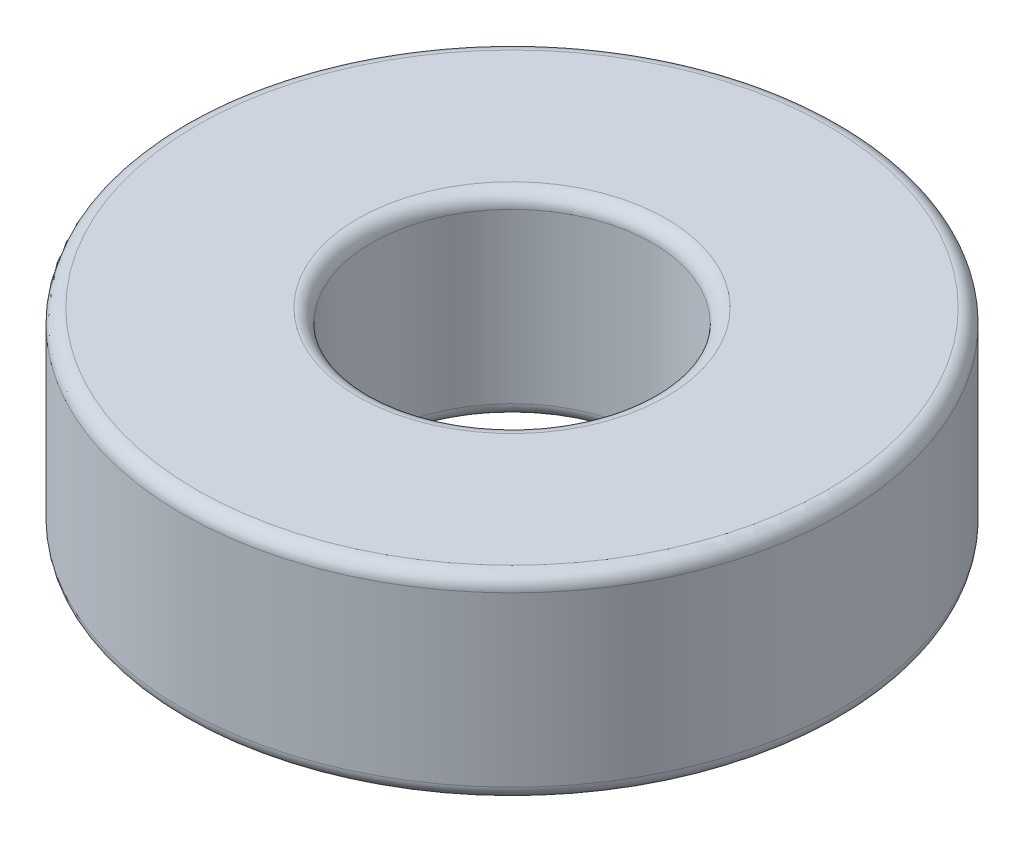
ISO-10303-21;
HEADER;
FILE_DESCRIPTION(('STEP AP214'),'2;1');
FILE_NAME('part.step','',(''),(''),'','','');
FILE_SCHEMA(('AUTOMOTIVE_DESIGN { 1 0 10303 214 1 1 1 1 }'));
ENDSEC;
DATA;
#1=APPLICATION_CONTEXT('core data for automotive mechanical design processes');
#2=APPLICATION_PROTOCOL_DEFINITION('international standard','automotive_design',2000,#1);
#3=PRODUCT_CONTEXT('',#1,'mechanical');
#4=PRODUCT('Part','Part','',(#3));
#5=PRODUCT_RELATED_PRODUCT_CATEGORY('part','',(#4));
#6=PRODUCT_DEFINITION_FORMATION('','',#4);
#7=PRODUCT_DEFINITION_CONTEXT('part definition',#1,'design');
#8=PRODUCT_DEFINITION('design','',#6,#7);
#9=PRODUCT_DEFINITION_SHAPE('','',#8);
#10=(LENGTH_UNIT() NAMED_UNIT(*) SI_UNIT(.MILLI.,.METRE.));
#11=(NAMED_UNIT(*) PLANE_ANGLE_UNIT() SI_UNIT($,.RADIAN.));
#12=(NAMED_UNIT(*) SI_UNIT($,.STERADIAN.) SOLID_ANGLE_UNIT());
#13=UNCERTAINTY_MEASURE_WITH_UNIT(LENGTH_MEASURE(1.E-05),#10,'distance_accuracy_value','');
#14=(GEOMETRIC_REPRESENTATION_CONTEXT(3) GLOBAL_UNCERTAINTY_ASSIGNED_CONTEXT((#13)) GLOBAL_UNIT_ASSIGNED_CONTEXT((#10,
#11,#12)) REPRESENTATION_CONTEXT('',''));
#15=CARTESIAN_POINT('',(0.,0.,0.));
#16=DIRECTION('',(0.,0.,1.));
#17=DIRECTION('',(1.,0.,0.));
#18=AXIS2_PLACEMENT_3D('',#15,#16,#17);
#19=CARTESIAN_POINT('',(0.,13.,0.));
#20=DIRECTION('',(0.,1.,0.));
#21=DIRECTION('',(0.,0.,1.));
#22=AXIS2_PLACEMENT_3D('',#19,#20,#21);
#23=TOROIDAL_SURFACE('',#22,11.,0.999999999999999);
#24=CARTESIAN_POINT('',(0.,13.,0.));
#25=DIRECTION('',(0.,1.,0.));
#26=DIRECTION('',(0.,0.,1.));
#27=AXIS2_PLACEMENT_3D('',#24,#25,#26);
#28=CIRCLE('',#27,10.);
#29=CARTESIAN_POINT('',(0.,13.,10.));
#30=VERTEX_POINT('',#29);
#31=EDGE_CURVE('E10',#30,#30,#28,.T.);
#32=ORIENTED_EDGE('',*,*,#31,.F.);
#33=EDGE_LOOP('',(#32));
#34=FACE_BOUND('',#33,.T.);
#35=CARTESIAN_POINT('',(0.,14.,0.));
#36=DIRECTION('',(0.,1.,0.));
#37=DIRECTION('',(0.,0.,1.));
#38=AXIS2_PLACEMENT_3D('',#35,#36,#37);
#39=CIRCLE('',#38,11.);
#40=CARTESIAN_POINT('',(0.,14.,11.));
#41=VERTEX_POINT('',#40);
#42=EDGE_CURVE('E54',#41,#41,#39,.T.);
#43=ORIENTED_EDGE('',*,*,#42,.T.);
#44=EDGE_LOOP('',(#43));
#45=FACE_BOUND('',#44,.T.);
#46=ADVANCED_FACE('F26',(#34,#45),#23,.T.);
#47=CARTESIAN_POINT('',(0.,15.5125,0.));
#48=DIRECTION('',(0.,1.,0.));
#49=DIRECTION('',(0.,0.,1.));
#50=AXIS2_PLACEMENT_3D('',#47,#48,#49);
#51=CYLINDRICAL_SURFACE('',#50,10.);
#52=ORIENTED_EDGE('',*,*,#31,.T.);
#53=EDGE_LOOP('',(#52));
#54=FACE_BOUND('',#53,.T.);
#55=CARTESIAN_POINT('',(0.,1.00000000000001,0.));
#56=DIRECTION('',(0.,1.,0.));
#57=DIRECTION('',(0.,0.,1.));
#58=AXIS2_PLACEMENT_3D('',#55,#56,#57);
#59=CIRCLE('',#58,9.99999999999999);
#60=CARTESIAN_POINT('',(0.,1.00000000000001,9.99999999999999));
#61=VERTEX_POINT('',#60);
#62=EDGE_CURVE('E32',#61,#61,#59,.T.);
#63=ORIENTED_EDGE('',*,*,#62,.F.);
#64=EDGE_LOOP('',(#63));
#65=FACE_BOUND('',#64,.T.);
#66=ADVANCED_FACE('F83',(#54,#65),#51,.F.);
#67=CARTESIAN_POINT('',(0.,0.999999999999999,0.));
#68=DIRECTION('',(0.,1.,0.));
#69=DIRECTION('',(0.,0.,1.));
#70=AXIS2_PLACEMENT_3D('',#67,#68,#69);
#71=TOROIDAL_SURFACE('',#70,11.,1.);
#72=CARTESIAN_POINT('',(0.,0.,0.));
#73=DIRECTION('',(0.,1.,0.));
#74=DIRECTION('',(0.,0.,1.));
#75=AXIS2_PLACEMENT_3D('',#72,#73,#74);
#76=CIRCLE('',#75,11.);
#77=CARTESIAN_POINT('',(0.,0.,11.));
#78=VERTEX_POINT('',#77);
#79=EDGE_CURVE('E36',#78,#78,#76,.T.);
#80=ORIENTED_EDGE('',*,*,#79,.F.);
#81=EDGE_LOOP('',(#80));
#82=FACE_BOUND('',#81,.T.);
#83=ORIENTED_EDGE('',*,*,#62,.T.);
#84=EDGE_LOOP('',(#83));
#85=FACE_BOUND('',#84,.T.);
#86=ADVANCED_FACE('F88',(#82,#85),#71,.T.);
#87=CARTESIAN_POINT('',(11.,0.,0.));
#88=DIRECTION('',(0.,1.,0.));
#89=DIRECTION('',(0.,0.,1.));
#90=AXIS2_PLACEMENT_3D('',#87,#88,#89);
#91=PLANE('',#90);
#92=CARTESIAN_POINT('',(0.,0.,0.));
#93=DIRECTION('',(0.,1.,0.));
#94=DIRECTION('',(0.,0.,1.));
#95=AXIS2_PLACEMENT_3D('',#92,#93,#94);
#96=CIRCLE('',#95,22.5);
#97=CARTESIAN_POINT('',(0.,0.,22.5));
#98=VERTEX_POINT('',#97);
#99=EDGE_CURVE('E40',#98,#98,#96,.T.);
#100=ORIENTED_EDGE('',*,*,#99,.F.);
#101=EDGE_LOOP('',(#100));
#102=FACE_BOUND('',#101,.T.);
#103=ORIENTED_EDGE('',*,*,#79,.T.);
#104=EDGE_LOOP('',(#103));
#105=FACE_BOUND('',#104,.T.);
#106=ADVANCED_FACE('F79',(#102,#105),#91,.F.);
#107=CARTESIAN_POINT('',(0.,0.999999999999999,0.));
#108=DIRECTION('',(0.,1.,0.));
#109=DIRECTION('',(0.,0.,1.));
#110=AXIS2_PLACEMENT_3D('',#107,#108,#109);
#111=TOROIDAL_SURFACE('',#110,22.5,1.);
#112=ORIENTED_EDGE('',*,*,#99,.T.);
#113=EDGE_LOOP('',(#112));
#114=FACE_BOUND('',#113,.T.);
#115=CARTESIAN_POINT('',(0.,1.00000000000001,0.));
#116=DIRECTION('',(0.,1.,0.));
#117=DIRECTION('',(0.,0.,1.));
#118=AXIS2_PLACEMENT_3D('',#115,#116,#117);
#119=CIRCLE('',#118,23.5);
#120=CARTESIAN_POINT('',(0.,1.00000000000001,23.5));
#121=VERTEX_POINT('',#120);
#122=EDGE_CURVE('E45',#121,#121,#119,.T.);
#123=ORIENTED_EDGE('',*,*,#122,.F.);
#124=EDGE_LOOP('',(#123));
#125=FACE_BOUND('',#124,.T.);
#126=ADVANCED_FACE('F73',(#114,#125),#111,.T.);
#127=CARTESIAN_POINT('',(0.,15.5125,0.));
#128=DIRECTION('',(0.,1.,0.));
#129=DIRECTION('',(0.,0.,1.));
#130=AXIS2_PLACEMENT_3D('',#127,#128,#129);
#131=CYLINDRICAL_SURFACE('',#130,23.5);
#132=ORIENTED_EDGE('',*,*,#122,.T.);
#133=EDGE_LOOP('',(#132));
#134=FACE_BOUND('',#133,.T.);
#135=CARTESIAN_POINT('',(0.,13.,0.));
#136=DIRECTION('',(0.,1.,0.));
#137=DIRECTION('',(0.,0.,1.));
#138=AXIS2_PLACEMENT_3D('',#135,#136,#137);
#139=CIRCLE('',#138,23.5);
#140=CARTESIAN_POINT('',(0.,13.,23.5));
#141=VERTEX_POINT('',#140);
#142=EDGE_CURVE('E48',#141,#141,#139,.T.);
#143=ORIENTED_EDGE('',*,*,#142,.F.);
#144=EDGE_LOOP('',(#143));
#145=FACE_BOUND('',#144,.T.);
#146=ADVANCED_FACE('F68',(#134,#145),#131,.T.);
#147=CARTESIAN_POINT('',(0.,13.,0.));
#148=DIRECTION('',(0.,1.,0.));
#149=DIRECTION('',(0.,0.,1.));
#150=AXIS2_PLACEMENT_3D('',#147,#148,#149);
#151=TOROIDAL_SURFACE('',#150,22.5,1.);
#152=CARTESIAN_POINT('',(0.,14.,0.));
#153=DIRECTION('',(0.,1.,0.));
#154=DIRECTION('',(0.,0.,1.));
#155=AXIS2_PLACEMENT_3D('',#152,#153,#154);
#156=CIRCLE('',#155,22.5);
#157=CARTESIAN_POINT('',(0.,14.,22.5));
#158=VERTEX_POINT('',#157);
#159=EDGE_CURVE('E51',#158,#158,#156,.T.);
#160=ORIENTED_EDGE('',*,*,#159,.F.);
#161=EDGE_LOOP('',(#160));
#162=FACE_BOUND('',#161,.T.);
#163=ORIENTED_EDGE('',*,*,#142,.T.);
#164=EDGE_LOOP('',(#163));
#165=FACE_BOUND('',#164,.T.);
#166=ADVANCED_FACE('F62',(#162,#165),#151,.T.);
#167=CARTESIAN_POINT('',(22.5,14.,0.));
#168=DIRECTION('',(0.,-1.,0.));
#169=DIRECTION('',(0.,0.,-1.));
#170=AXIS2_PLACEMENT_3D('',#167,#168,#169);
#171=PLANE('',#170);
#172=ORIENTED_EDGE('',*,*,#42,.F.);
#173=EDGE_LOOP('',(#172));
#174=FACE_BOUND('',#173,.T.);
#175=ORIENTED_EDGE('',*,*,#159,.T.);
#176=EDGE_LOOP('',(#175));
#177=FACE_BOUND('',#176,.T.);
#178=ADVANCED_FACE('F59',(#174,#177),#171,.F.);
#179=CLOSED_SHELL('',(#46,#66,#86,#106,#126,#146,#166,#178));
#180=MANIFOLD_SOLID_BREP('B2',#179);
#181=ADVANCED_BREP_SHAPE_REPRESENTATION('',(#18,#180),#14);
#182=SHAPE_DEFINITION_REPRESENTATION(#9,#181);
ENDSEC;
END-ISO-10303-21;
